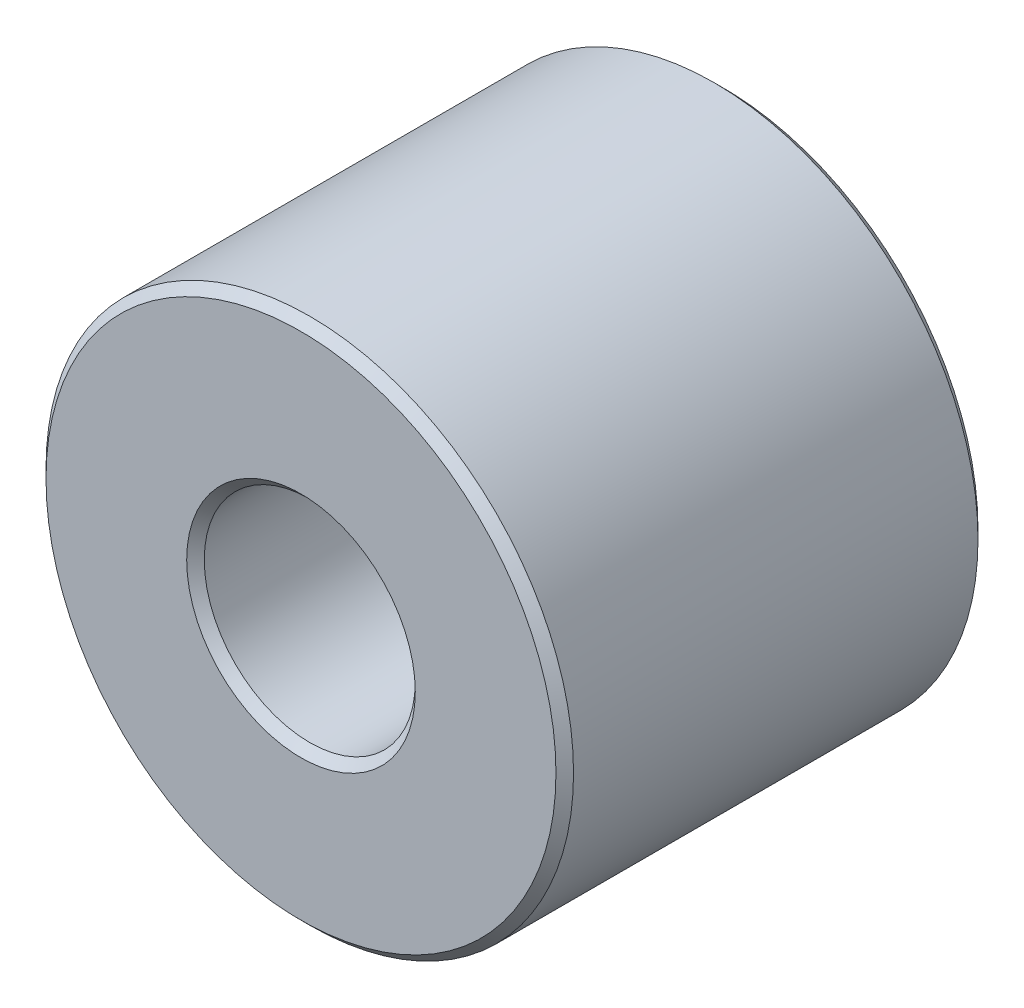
ISO-10303-21;
HEADER;
FILE_DESCRIPTION(('STEP AP214'),'2;1');
FILE_NAME('part.step','',(''),(''),'','','');
FILE_SCHEMA(('AUTOMOTIVE_DESIGN { 1 0 10303 214 1 1 1 1 }'));
ENDSEC;
DATA;
#1=APPLICATION_CONTEXT('core data for automotive mechanical design processes');
#2=APPLICATION_PROTOCOL_DEFINITION('international standard','automotive_design',2000,#1);
#3=PRODUCT_CONTEXT('',#1,'mechanical');
#4=PRODUCT('Part','Part','',(#3));
#5=PRODUCT_RELATED_PRODUCT_CATEGORY('part','',(#4));
#6=PRODUCT_DEFINITION_FORMATION('','',#4);
#7=PRODUCT_DEFINITION_CONTEXT('part definition',#1,'design');
#8=PRODUCT_DEFINITION('design','',#6,#7);
#9=PRODUCT_DEFINITION_SHAPE('','',#8);
#10=(LENGTH_UNIT() NAMED_UNIT(*) SI_UNIT(.MILLI.,.METRE.));
#11=(NAMED_UNIT(*) PLANE_ANGLE_UNIT() SI_UNIT($,.RADIAN.));
#12=(NAMED_UNIT(*) SI_UNIT($,.STERADIAN.) SOLID_ANGLE_UNIT());
#13=UNCERTAINTY_MEASURE_WITH_UNIT(LENGTH_MEASURE(1.E-05),#10,'distance_accuracy_value','');
#14=(GEOMETRIC_REPRESENTATION_CONTEXT(3) GLOBAL_UNCERTAINTY_ASSIGNED_CONTEXT((#13)) GLOBAL_UNIT_ASSIGNED_CONTEXT((#10,
#11,#12)) REPRESENTATION_CONTEXT('',''));
#15=CARTESIAN_POINT('',(0.,0.,0.));
#16=DIRECTION('',(0.,0.,1.));
#17=DIRECTION('',(1.,0.,0.));
#18=AXIS2_PLACEMENT_3D('',#15,#16,#17);
#19=CARTESIAN_POINT('',(0.,0.,12.));
#20=DIRECTION('',(0.,0.,1.));
#21=DIRECTION('',(1.,0.,0.));
#22=AXIS2_PLACEMENT_3D('',#19,#20,#21);
#23=PLANE('',#22);
#24=CARTESIAN_POINT('',(0.,0.,12.));
#25=DIRECTION('',(0.,0.,1.));
#26=DIRECTION('',(1.,0.,0.));
#27=AXIS2_PLACEMENT_3D('',#24,#25,#26);
#28=CIRCLE('',#27,7.25000000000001);
#29=CARTESIAN_POINT('',(7.25000000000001,0.,12.));
#30=VERTEX_POINT('',#29);
#31=EDGE_CURVE('E40',#30,#30,#28,.T.);
#32=ORIENTED_EDGE('',*,*,#31,.T.);
#33=EDGE_LOOP('',(#32));
#34=FACE_BOUND('',#33,.T.);
#35=CARTESIAN_POINT('',(0.,0.,12.));
#36=DIRECTION('',(0.,0.,1.));
#37=DIRECTION('',(1.,0.,0.));
#38=AXIS2_PLACEMENT_3D('',#35,#36,#37);
#39=CIRCLE('',#38,3.25);
#40=CARTESIAN_POINT('',(3.25,0.,12.));
#41=VERTEX_POINT('',#40);
#42=EDGE_CURVE('E44',#41,#41,#39,.F.);
#43=ORIENTED_EDGE('',*,*,#42,.T.);
#44=EDGE_LOOP('',(#43));
#45=FACE_BOUND('',#44,.T.);
#46=ADVANCED_FACE('F29',(#34,#45),#23,.T.);
#47=CARTESIAN_POINT('',(0.,0.,0.));
#48=DIRECTION('',(0.,0.,1.));
#49=DIRECTION('',(1.,0.,0.));
#50=AXIS2_PLACEMENT_3D('',#47,#48,#49);
#51=PLANE('',#50);
#52=CARTESIAN_POINT('',(0.,0.,0.));
#53=DIRECTION('',(0.,0.,1.));
#54=DIRECTION('',(1.,0.,0.));
#55=AXIS2_PLACEMENT_3D('',#52,#53,#54);
#56=CIRCLE('',#55,7.25);
#57=CARTESIAN_POINT('',(7.25,0.,0.));
#58=VERTEX_POINT('',#57);
#59=EDGE_CURVE('E49',#58,#58,#56,.F.);
#60=ORIENTED_EDGE('',*,*,#59,.T.);
#61=EDGE_LOOP('',(#60));
#62=FACE_BOUND('',#61,.T.);
#63=CARTESIAN_POINT('',(0.,0.,0.));
#64=DIRECTION('',(0.,0.,1.));
#65=DIRECTION('',(1.,0.,0.));
#66=AXIS2_PLACEMENT_3D('',#63,#64,#65);
#67=CIRCLE('',#66,3.25);
#68=CARTESIAN_POINT('',(3.25,0.,0.));
#69=VERTEX_POINT('',#68);
#70=EDGE_CURVE('E52',#69,#69,#67,.T.);
#71=ORIENTED_EDGE('',*,*,#70,.T.);
#72=EDGE_LOOP('',(#71));
#73=FACE_BOUND('',#72,.T.);
#74=ADVANCED_FACE('F74',(#62,#73),#51,.F.);
#75=CARTESIAN_POINT('',(0.,0.,12.));
#76=DIRECTION('',(0.,0.,-1.));
#77=DIRECTION('',(-1.,0.,0.));
#78=AXIS2_PLACEMENT_3D('',#75,#76,#77);
#79=CYLINDRICAL_SURFACE('',#78,7.5);
#80=CARTESIAN_POINT('',(0.,0.,0.249999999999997));
#81=DIRECTION('',(0.,0.,1.));
#82=DIRECTION('',(1.,0.,0.));
#83=AXIS2_PLACEMENT_3D('',#80,#81,#82);
#84=CIRCLE('',#83,7.5);
#85=CARTESIAN_POINT('',(7.5,0.,0.249999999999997));
#86=VERTEX_POINT('',#85);
#87=EDGE_CURVE('E55',#86,#86,#84,.T.);
#88=ORIENTED_EDGE('',*,*,#87,.T.);
#89=EDGE_LOOP('',(#88));
#90=FACE_BOUND('',#89,.T.);
#91=CARTESIAN_POINT('',(0.,0.,11.75));
#92=DIRECTION('',(0.,0.,1.));
#93=DIRECTION('',(1.,0.,0.));
#94=AXIS2_PLACEMENT_3D('',#91,#92,#93);
#95=CIRCLE('',#94,7.5);
#96=CARTESIAN_POINT('',(7.5,0.,11.75));
#97=VERTEX_POINT('',#96);
#98=EDGE_CURVE('E58',#97,#97,#95,.F.);
#99=ORIENTED_EDGE('',*,*,#98,.T.);
#100=EDGE_LOOP('',(#99));
#101=FACE_BOUND('',#100,.T.);
#102=ADVANCED_FACE('F62',(#90,#101),#79,.T.);
#103=CARTESIAN_POINT('',(0.,0.,12.));
#104=DIRECTION('',(0.,0.,-1.));
#105=DIRECTION('',(-1.,0.,0.));
#106=AXIS2_PLACEMENT_3D('',#103,#104,#105);
#107=CYLINDRICAL_SURFACE('',#106,3.);
#108=CARTESIAN_POINT('',(0.,0.,0.25));
#109=DIRECTION('',(0.,0.,1.));
#110=DIRECTION('',(1.,0.,0.));
#111=AXIS2_PLACEMENT_3D('',#108,#109,#110);
#112=CIRCLE('',#111,3.);
#113=CARTESIAN_POINT('',(3.,0.,0.25));
#114=VERTEX_POINT('',#113);
#115=EDGE_CURVE('E10',#114,#114,#112,.F.);
#116=ORIENTED_EDGE('',*,*,#115,.T.);
#117=EDGE_LOOP('',(#116));
#118=FACE_BOUND('',#117,.T.);
#119=CARTESIAN_POINT('',(0.,0.,11.75));
#120=DIRECTION('',(0.,0.,1.));
#121=DIRECTION('',(1.,0.,0.));
#122=AXIS2_PLACEMENT_3D('',#119,#120,#121);
#123=CIRCLE('',#122,3.);
#124=CARTESIAN_POINT('',(3.,0.,11.75));
#125=VERTEX_POINT('',#124);
#126=EDGE_CURVE('E36',#125,#125,#123,.T.);
#127=ORIENTED_EDGE('',*,*,#126,.T.);
#128=EDGE_LOOP('',(#127));
#129=FACE_BOUND('',#128,.T.);
#130=ADVANCED_FACE('F90',(#118,#129),#107,.F.);
#131=CARTESIAN_POINT('',(0.,0.,0.249999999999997));
#132=DIRECTION('',(0.,0.,1.));
#133=DIRECTION('',(1.,0.,0.));
#134=AXIS2_PLACEMENT_3D('',#131,#132,#133);
#135=CONICAL_SURFACE('',#134,7.5,0.78539816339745);
#136=ORIENTED_EDGE('',*,*,#59,.F.);
#137=EDGE_LOOP('',(#136));
#138=FACE_BOUND('',#137,.T.);
#139=ORIENTED_EDGE('',*,*,#87,.F.);
#140=EDGE_LOOP('',(#139));
#141=FACE_BOUND('',#140,.T.);
#142=ADVANCED_FACE('F68',(#138,#141),#135,.T.);
#143=CARTESIAN_POINT('',(0.,0.,12.));
#144=DIRECTION('',(0.,0.,-1.));
#145=DIRECTION('',(-1.,0.,0.));
#146=AXIS2_PLACEMENT_3D('',#143,#144,#145);
#147=CONICAL_SURFACE('',#146,7.25000000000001,0.785398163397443);
#148=ORIENTED_EDGE('',*,*,#98,.F.);
#149=EDGE_LOOP('',(#148));
#150=FACE_BOUND('',#149,.T.);
#151=ORIENTED_EDGE('',*,*,#31,.F.);
#152=EDGE_LOOP('',(#151));
#153=FACE_BOUND('',#152,.T.);
#154=ADVANCED_FACE('F64',(#150,#153),#147,.T.);
#155=CARTESIAN_POINT('',(0.,0.,0.));
#156=DIRECTION('',(0.,0.,-1.));
#157=DIRECTION('',(-1.,0.,0.));
#158=AXIS2_PLACEMENT_3D('',#155,#156,#157);
#159=CONICAL_SURFACE('',#158,3.25,0.785398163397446);
#160=ORIENTED_EDGE('',*,*,#115,.F.);
#161=EDGE_LOOP('',(#160));
#162=FACE_BOUND('',#161,.T.);
#163=ORIENTED_EDGE('',*,*,#70,.F.);
#164=EDGE_LOOP('',(#163));
#165=FACE_BOUND('',#164,.T.);
#166=ADVANCED_FACE('F67',(#162,#165),#159,.F.);
#167=CARTESIAN_POINT('',(0.,0.,11.75));
#168=DIRECTION('',(0.,0.,1.));
#169=DIRECTION('',(1.,0.,0.));
#170=AXIS2_PLACEMENT_3D('',#167,#168,#169);
#171=CONICAL_SURFACE('',#170,3.,0.785398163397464);
#172=ORIENTED_EDGE('',*,*,#42,.F.);
#173=EDGE_LOOP('',(#172));
#174=FACE_BOUND('',#173,.T.);
#175=ORIENTED_EDGE('',*,*,#126,.F.);
#176=EDGE_LOOP('',(#175));
#177=FACE_BOUND('',#176,.T.);
#178=ADVANCED_FACE('F31',(#174,#177),#171,.F.);
#179=CLOSED_SHELL('',(#46,#74,#102,#130,#142,#154,#166,#178));
#180=MANIFOLD_SOLID_BREP('B2',#179);
#181=ADVANCED_BREP_SHAPE_REPRESENTATION('',(#18,#180),#14);
#182=SHAPE_DEFINITION_REPRESENTATION(#9,#181);
ENDSEC;
END-ISO-10303-21;
